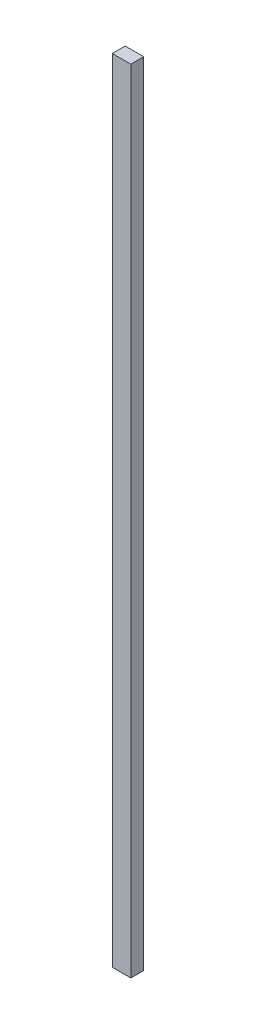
from build123d import *

# Parameters (mm, degrees)
SKETCH1_W      = 5.461
SKETCH1_H      = 233.299
EXTRUDE1_DEPTH = 3.81


with BuildPart() as part:
    # Sketch1 → Extrude1 (new body)
    with BuildSketch(Plane.XY):
        with Locations((-7.884361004, 65.969866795)):
            Rectangle(SKETCH1_W, SKETCH1_H)
    extrude(amount=EXTRUDE1_DEPTH)


solid = part.part
